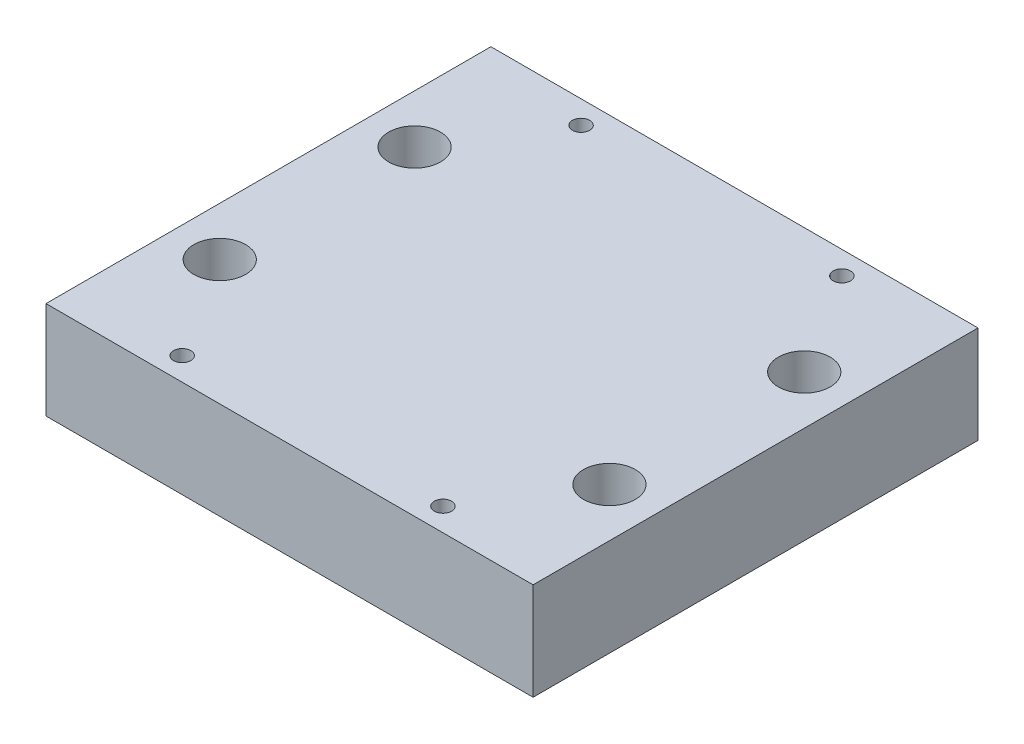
ISO-10303-21;
HEADER;
FILE_DESCRIPTION(('STEP AP214'),'2;1');
FILE_NAME('part.step','',(''),(''),'','','');
FILE_SCHEMA(('AUTOMOTIVE_DESIGN { 1 0 10303 214 1 1 1 1 }'));
ENDSEC;
DATA;
#1=APPLICATION_CONTEXT('core data for automotive mechanical design processes');
#2=APPLICATION_PROTOCOL_DEFINITION('international standard','automotive_design',2000,#1);
#3=PRODUCT_CONTEXT('',#1,'mechanical');
#4=PRODUCT('Part','Part','',(#3));
#5=PRODUCT_RELATED_PRODUCT_CATEGORY('part','',(#4));
#6=PRODUCT_DEFINITION_FORMATION('','',#4);
#7=PRODUCT_DEFINITION_CONTEXT('part definition',#1,'design');
#8=PRODUCT_DEFINITION('design','',#6,#7);
#9=PRODUCT_DEFINITION_SHAPE('','',#8);
#10=(LENGTH_UNIT() NAMED_UNIT(*) SI_UNIT(.MILLI.,.METRE.));
#11=(NAMED_UNIT(*) PLANE_ANGLE_UNIT() SI_UNIT($,.RADIAN.));
#12=(NAMED_UNIT(*) SI_UNIT($,.STERADIAN.) SOLID_ANGLE_UNIT());
#13=UNCERTAINTY_MEASURE_WITH_UNIT(LENGTH_MEASURE(1.E-05),#10,'distance_accuracy_value','');
#14=(GEOMETRIC_REPRESENTATION_CONTEXT(3) GLOBAL_UNCERTAINTY_ASSIGNED_CONTEXT((#13)) GLOBAL_UNIT_ASSIGNED_CONTEXT((#10,
#11,#12)) REPRESENTATION_CONTEXT('',''));
#15=CARTESIAN_POINT('',(0.,0.,0.));
#16=DIRECTION('',(0.,0.,1.));
#17=DIRECTION('',(1.,0.,0.));
#18=AXIS2_PLACEMENT_3D('',#15,#16,#17);
#19=CARTESIAN_POINT('',(-31.75,12.7,29.));
#20=DIRECTION('',(-1.,0.,0.));
#21=DIRECTION('',(0.,0.,1.));
#22=AXIS2_PLACEMENT_3D('',#19,#20,#21);
#23=PLANE('',#22);
#24=DIRECTION('',(0.,0.,-1.));
#25=VECTOR('',#24,1.);
#26=CARTESIAN_POINT('',(-31.75,0.,29.));
#27=LINE('',#26,#25);
#28=CARTESIAN_POINT('',(-31.75,0.,29.));
#29=VERTEX_POINT('',#28);
#30=CARTESIAN_POINT('',(-31.75,0.,-29.));
#31=VERTEX_POINT('',#30);
#32=EDGE_CURVE('E144',#29,#31,#27,.T.);
#33=ORIENTED_EDGE('',*,*,#32,.F.);
#34=DIRECTION('',(0.,-1.,0.));
#35=VECTOR('',#34,1.);
#36=CARTESIAN_POINT('',(-31.75,12.7,29.));
#37=LINE('',#36,#35);
#38=CARTESIAN_POINT('',(-31.75,12.7,29.));
#39=VERTEX_POINT('',#38);
#40=EDGE_CURVE('E11',#39,#29,#37,.T.);
#41=ORIENTED_EDGE('',*,*,#40,.F.);
#42=DIRECTION('',(0.,0.,-1.));
#43=VECTOR('',#42,1.);
#44=CARTESIAN_POINT('',(-31.75,12.7,29.));
#45=LINE('',#44,#43);
#46=CARTESIAN_POINT('',(-31.75,12.7,-29.));
#47=VERTEX_POINT('',#46);
#48=EDGE_CURVE('E145',#39,#47,#45,.T.);
#49=ORIENTED_EDGE('',*,*,#48,.T.);
#50=DIRECTION('',(0.,-1.,0.));
#51=VECTOR('',#50,1.);
#52=CARTESIAN_POINT('',(-31.75,12.7,-29.));
#53=LINE('',#52,#51);
#54=EDGE_CURVE('E46',#47,#31,#53,.T.);
#55=ORIENTED_EDGE('',*,*,#54,.T.);
#56=EDGE_LOOP('',(#33,#41,#49,#55));
#57=FACE_BOUND('',#56,.T.);
#58=ADVANCED_FACE('F43',(#57),#23,.T.);
#59=CARTESIAN_POINT('',(-31.75,12.7,29.));
#60=DIRECTION('',(0.,0.,-1.));
#61=DIRECTION('',(-1.,0.,0.));
#62=AXIS2_PLACEMENT_3D('',#59,#60,#61);
#63=PLANE('',#62);
#64=DIRECTION('',(1.,0.,0.));
#65=VECTOR('',#64,1.);
#66=CARTESIAN_POINT('',(-31.75,0.,29.));
#67=LINE('',#66,#65);
#68=CARTESIAN_POINT('',(31.75,0.,29.));
#69=VERTEX_POINT('',#68);
#70=EDGE_CURVE('E78',#29,#69,#67,.T.);
#71=ORIENTED_EDGE('',*,*,#70,.T.);
#72=DIRECTION('',(0.,-1.,0.));
#73=VECTOR('',#72,1.);
#74=CARTESIAN_POINT('',(31.75,12.7,29.));
#75=LINE('',#74,#73);
#76=CARTESIAN_POINT('',(31.75,12.7,29.));
#77=VERTEX_POINT('',#76);
#78=EDGE_CURVE('E53',#77,#69,#75,.T.);
#79=ORIENTED_EDGE('',*,*,#78,.F.);
#80=DIRECTION('',(1.,0.,0.));
#81=VECTOR('',#80,1.);
#82=CARTESIAN_POINT('',(-31.75,12.7,29.));
#83=LINE('',#82,#81);
#84=EDGE_CURVE('E154',#39,#77,#83,.T.);
#85=ORIENTED_EDGE('',*,*,#84,.F.);
#86=ORIENTED_EDGE('',*,*,#40,.T.);
#87=EDGE_LOOP('',(#71,#79,#85,#86));
#88=FACE_BOUND('',#87,.T.);
#89=ADVANCED_FACE('F185',(#88),#63,.F.);
#90=CARTESIAN_POINT('',(31.75,12.7,29.));
#91=DIRECTION('',(-1.,0.,0.));
#92=DIRECTION('',(0.,0.,1.));
#93=AXIS2_PLACEMENT_3D('',#90,#91,#92);
#94=PLANE('',#93);
#95=DIRECTION('',(0.,0.,-1.));
#96=VECTOR('',#95,1.);
#97=CARTESIAN_POINT('',(31.75,0.,29.));
#98=LINE('',#97,#96);
#99=CARTESIAN_POINT('',(31.75,0.,-29.));
#100=VERTEX_POINT('',#99);
#101=EDGE_CURVE('E164',#69,#100,#98,.T.);
#102=ORIENTED_EDGE('',*,*,#101,.T.);
#103=DIRECTION('',(0.,-1.,0.));
#104=VECTOR('',#103,1.);
#105=CARTESIAN_POINT('',(31.75,12.7,-29.));
#106=LINE('',#105,#104);
#107=CARTESIAN_POINT('',(31.75,12.7,-29.));
#108=VERTEX_POINT('',#107);
#109=EDGE_CURVE('E171',#108,#100,#106,.T.);
#110=ORIENTED_EDGE('',*,*,#109,.F.);
#111=DIRECTION('',(0.,0.,-1.));
#112=VECTOR('',#111,1.);
#113=CARTESIAN_POINT('',(31.75,12.7,29.));
#114=LINE('',#113,#112);
#115=EDGE_CURVE('E151',#77,#108,#114,.T.);
#116=ORIENTED_EDGE('',*,*,#115,.F.);
#117=ORIENTED_EDGE('',*,*,#78,.T.);
#118=EDGE_LOOP('',(#102,#110,#116,#117));
#119=FACE_BOUND('',#118,.T.);
#120=ADVANCED_FACE('F183',(#119),#94,.F.);
#121=CARTESIAN_POINT('',(-31.75,12.7,-29.));
#122=DIRECTION('',(0.,0.,-1.));
#123=DIRECTION('',(-1.,0.,0.));
#124=AXIS2_PLACEMENT_3D('',#121,#122,#123);
#125=PLANE('',#124);
#126=DIRECTION('',(1.,0.,0.));
#127=VECTOR('',#126,1.);
#128=CARTESIAN_POINT('',(-31.75,0.,-29.));
#129=LINE('',#128,#127);
#130=EDGE_CURVE('E160',#31,#100,#129,.T.);
#131=ORIENTED_EDGE('',*,*,#130,.F.);
#132=ORIENTED_EDGE('',*,*,#54,.F.);
#133=DIRECTION('',(1.,0.,0.));
#134=VECTOR('',#133,1.);
#135=CARTESIAN_POINT('',(-31.75,12.7,-29.));
#136=LINE('',#135,#134);
#137=EDGE_CURVE('E148',#47,#108,#136,.T.);
#138=ORIENTED_EDGE('',*,*,#137,.T.);
#139=ORIENTED_EDGE('',*,*,#109,.T.);
#140=EDGE_LOOP('',(#131,#132,#138,#139));
#141=FACE_BOUND('',#140,.T.);
#142=ADVANCED_FACE('F178',(#141),#125,.T.);
#143=CARTESIAN_POINT('',(0.,12.7,0.));
#144=DIRECTION('',(0.,-1.,0.));
#145=DIRECTION('',(0.,0.,-1.));
#146=AXIS2_PLACEMENT_3D('',#143,#144,#145);
#147=PLANE('',#146);
#148=CARTESIAN_POINT('',(-25.4,12.7,-12.7));
#149=DIRECTION('',(0.,1.,0.));
#150=DIRECTION('',(0.,0.,1.));
#151=AXIS2_PLACEMENT_3D('',#148,#149,#150);
#152=CIRCLE('',#151,3.37819999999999);
#153=CARTESIAN_POINT('',(-25.4,12.7,-9.32180000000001));
#154=VERTEX_POINT('',#153);
#155=EDGE_CURVE('E432',#154,#154,#152,.T.);
#156=ORIENTED_EDGE('',*,*,#155,.F.);
#157=EDGE_LOOP('',(#156));
#158=FACE_BOUND('',#157,.T.);
#159=CARTESIAN_POINT('',(25.4,12.7,-12.7));
#160=DIRECTION('',(0.,1.,0.));
#161=DIRECTION('',(0.,0.,1.));
#162=AXIS2_PLACEMENT_3D('',#159,#160,#161);
#163=CIRCLE('',#162,3.37819999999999);
#164=CARTESIAN_POINT('',(25.4,12.7,-9.32180000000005));
#165=VERTEX_POINT('',#164);
#166=EDGE_CURVE('E437',#165,#165,#163,.T.);
#167=ORIENTED_EDGE('',*,*,#166,.F.);
#168=EDGE_LOOP('',(#167));
#169=FACE_BOUND('',#168,.T.);
#170=CARTESIAN_POINT('',(-25.4,12.7,12.7));
#171=DIRECTION('',(0.,1.,0.));
#172=DIRECTION('',(0.,0.,1.));
#173=AXIS2_PLACEMENT_3D('',#170,#171,#172);
#174=CIRCLE('',#173,3.37819999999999);
#175=CARTESIAN_POINT('',(-25.4,12.7,16.0782));
#176=VERTEX_POINT('',#175);
#177=EDGE_CURVE('E447',#176,#176,#174,.T.);
#178=ORIENTED_EDGE('',*,*,#177,.F.);
#179=EDGE_LOOP('',(#178));
#180=FACE_BOUND('',#179,.T.);
#181=CARTESIAN_POINT('',(25.4,12.7,12.7));
#182=DIRECTION('',(0.,1.,0.));
#183=DIRECTION('',(0.,0.,1.));
#184=AXIS2_PLACEMENT_3D('',#181,#182,#183);
#185=CIRCLE('',#184,3.37819999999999);
#186=CARTESIAN_POINT('',(25.4,12.7,16.0782));
#187=VERTEX_POINT('',#186);
#188=EDGE_CURVE('E455',#187,#187,#185,.T.);
#189=ORIENTED_EDGE('',*,*,#188,.F.);
#190=EDGE_LOOP('',(#189));
#191=FACE_BOUND('',#190,.T.);
#192=CARTESIAN_POINT('',(-17.,12.7,-26.));
#193=DIRECTION('',(0.,1.,0.));
#194=DIRECTION('',(0.,0.,1.));
#195=AXIS2_PLACEMENT_3D('',#192,#193,#194);
#196=CIRCLE('',#195,1.13029999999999);
#197=CARTESIAN_POINT('',(-17.,12.7,-24.8697));
#198=VERTEX_POINT('',#197);
#199=EDGE_CURVE('E112',#198,#198,#196,.T.);
#200=ORIENTED_EDGE('',*,*,#199,.F.);
#201=EDGE_LOOP('',(#200));
#202=FACE_BOUND('',#201,.T.);
#203=CARTESIAN_POINT('',(17.,12.7,-26.));
#204=DIRECTION('',(0.,1.,0.));
#205=DIRECTION('',(0.,0.,1.));
#206=AXIS2_PLACEMENT_3D('',#203,#204,#205);
#207=CIRCLE('',#206,1.13029999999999);
#208=CARTESIAN_POINT('',(17.,12.7,-24.8697));
#209=VERTEX_POINT('',#208);
#210=EDGE_CURVE('E111',#209,#209,#207,.T.);
#211=ORIENTED_EDGE('',*,*,#210,.F.);
#212=EDGE_LOOP('',(#211));
#213=FACE_BOUND('',#212,.T.);
#214=CARTESIAN_POINT('',(17.,12.7,26.));
#215=DIRECTION('',(0.,1.,0.));
#216=DIRECTION('',(0.,0.,1.));
#217=AXIS2_PLACEMENT_3D('',#214,#215,#216);
#218=CIRCLE('',#217,1.13029999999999);
#219=CARTESIAN_POINT('',(17.,12.7,27.1303));
#220=VERTEX_POINT('',#219);
#221=EDGE_CURVE('E128',#220,#220,#218,.T.);
#222=ORIENTED_EDGE('',*,*,#221,.F.);
#223=EDGE_LOOP('',(#222));
#224=FACE_BOUND('',#223,.T.);
#225=CARTESIAN_POINT('',(-17.,12.7,26.));
#226=DIRECTION('',(0.,1.,0.));
#227=DIRECTION('',(0.,0.,1.));
#228=AXIS2_PLACEMENT_3D('',#225,#226,#227);
#229=CIRCLE('',#228,1.13029999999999);
#230=CARTESIAN_POINT('',(-17.,12.7,27.1303));
#231=VERTEX_POINT('',#230);
#232=EDGE_CURVE('E136',#231,#231,#229,.T.);
#233=ORIENTED_EDGE('',*,*,#232,.F.);
#234=EDGE_LOOP('',(#233));
#235=FACE_BOUND('',#234,.T.);
#236=ORIENTED_EDGE('',*,*,#48,.F.);
#237=ORIENTED_EDGE('',*,*,#84,.T.);
#238=ORIENTED_EDGE('',*,*,#115,.T.);
#239=ORIENTED_EDGE('',*,*,#137,.F.);
#240=EDGE_LOOP('',(#236,#237,#238,#239));
#241=FACE_BOUND('',#240,.T.);
#242=ADVANCED_FACE('F187',(#158,#169,#180,#191,#202,#213,#224,#235,#241),#147,.F.);
#243=CARTESIAN_POINT('',(0.,0.,0.));
#244=DIRECTION('',(0.,-1.,0.));
#245=DIRECTION('',(0.,0.,-1.));
#246=AXIS2_PLACEMENT_3D('',#243,#244,#245);
#247=PLANE('',#246);
#248=CARTESIAN_POINT('',(-25.4,0.,-12.7));
#249=DIRECTION('',(0.,1.,0.));
#250=DIRECTION('',(0.,0.,1.));
#251=AXIS2_PLACEMENT_3D('',#248,#249,#250);
#252=CIRCLE('',#251,3.37819999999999);
#253=CARTESIAN_POINT('',(-25.4,0.,-9.32180000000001));
#254=VERTEX_POINT('',#253);
#255=EDGE_CURVE('E430',#254,#254,#252,.T.);
#256=ORIENTED_EDGE('',*,*,#255,.T.);
#257=EDGE_LOOP('',(#256));
#258=FACE_BOUND('',#257,.T.);
#259=CARTESIAN_POINT('',(25.4,0.,-12.7));
#260=DIRECTION('',(0.,1.,0.));
#261=DIRECTION('',(0.,0.,1.));
#262=AXIS2_PLACEMENT_3D('',#259,#260,#261);
#263=CIRCLE('',#262,3.37819999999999);
#264=CARTESIAN_POINT('',(25.4,0.,-9.32180000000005));
#265=VERTEX_POINT('',#264);
#266=EDGE_CURVE('E443',#265,#265,#263,.T.);
#267=ORIENTED_EDGE('',*,*,#266,.T.);
#268=EDGE_LOOP('',(#267));
#269=FACE_BOUND('',#268,.T.);
#270=CARTESIAN_POINT('',(-25.4,0.,12.7));
#271=DIRECTION('',(0.,1.,0.));
#272=DIRECTION('',(0.,0.,1.));
#273=AXIS2_PLACEMENT_3D('',#270,#271,#272);
#274=CIRCLE('',#273,3.37819999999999);
#275=CARTESIAN_POINT('',(-25.4,0.,16.0782));
#276=VERTEX_POINT('',#275);
#277=EDGE_CURVE('E451',#276,#276,#274,.T.);
#278=ORIENTED_EDGE('',*,*,#277,.T.);
#279=EDGE_LOOP('',(#278));
#280=FACE_BOUND('',#279,.T.);
#281=CARTESIAN_POINT('',(25.4,0.,12.7));
#282=DIRECTION('',(0.,1.,0.));
#283=DIRECTION('',(0.,0.,1.));
#284=AXIS2_PLACEMENT_3D('',#281,#282,#283);
#285=CIRCLE('',#284,3.37819999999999);
#286=CARTESIAN_POINT('',(25.4,0.,16.0782));
#287=VERTEX_POINT('',#286);
#288=EDGE_CURVE('E121',#287,#287,#285,.T.);
#289=ORIENTED_EDGE('',*,*,#288,.T.);
#290=EDGE_LOOP('',(#289));
#291=FACE_BOUND('',#290,.T.);
#292=ORIENTED_EDGE('',*,*,#32,.T.);
#293=ORIENTED_EDGE('',*,*,#130,.T.);
#294=ORIENTED_EDGE('',*,*,#101,.F.);
#295=ORIENTED_EDGE('',*,*,#70,.F.);
#296=EDGE_LOOP('',(#292,#293,#294,#295));
#297=FACE_BOUND('',#296,.T.);
#298=ADVANCED_FACE('F181',(#258,#269,#280,#291,#297),#247,.T.);
#299=CARTESIAN_POINT('',(-17.,6.35,26.));
#300=DIRECTION('',(0.,1.,0.));
#301=DIRECTION('',(0.,0.,1.));
#302=AXIS2_PLACEMENT_3D('',#299,#300,#301);
#303=CONICAL_SURFACE('',#302,1.1303,1.02974425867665);
#304=CARTESIAN_POINT('',(-17.,5.67084724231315,26.));
#305=VERTEX_POINT('',#304);
#306=VERTEX_LOOP('',#305);
#307=FACE_BOUND('',#306,.T.);
#308=CARTESIAN_POINT('',(-17.,6.35,26.));
#309=DIRECTION('',(0.,1.,0.));
#310=DIRECTION('',(0.,0.,1.));
#311=AXIS2_PLACEMENT_3D('',#308,#309,#310);
#312=CIRCLE('',#311,1.1303);
#313=CARTESIAN_POINT('',(-17.,6.35,27.1303));
#314=VERTEX_POINT('',#313);
#315=EDGE_CURVE('E140',#314,#314,#312,.T.);
#316=ORIENTED_EDGE('',*,*,#315,.T.);
#317=EDGE_LOOP('',(#316));
#318=FACE_BOUND('',#317,.T.);
#319=ADVANCED_FACE('F195',(#307,#318),#303,.F.);
#320=CARTESIAN_POINT('',(-17.,12.7,26.));
#321=DIRECTION('',(0.,1.,0.));
#322=DIRECTION('',(0.,0.,1.));
#323=AXIS2_PLACEMENT_3D('',#320,#321,#322);
#324=CYLINDRICAL_SURFACE('',#323,1.13029999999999);
#325=ORIENTED_EDGE('',*,*,#315,.F.);
#326=EDGE_LOOP('',(#325));
#327=FACE_BOUND('',#326,.T.);
#328=ORIENTED_EDGE('',*,*,#232,.T.);
#329=EDGE_LOOP('',(#328));
#330=FACE_BOUND('',#329,.T.);
#331=ADVANCED_FACE('F227',(#327,#330),#324,.F.);
#332=CARTESIAN_POINT('',(17.,6.35,26.));
#333=DIRECTION('',(0.,1.,0.));
#334=DIRECTION('',(0.,0.,1.));
#335=AXIS2_PLACEMENT_3D('',#332,#333,#334);
#336=CONICAL_SURFACE('',#335,1.1303,1.02974425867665);
#337=CARTESIAN_POINT('',(17.,5.67084724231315,26.));
#338=VERTEX_POINT('',#337);
#339=VERTEX_LOOP('',#338);
#340=FACE_BOUND('',#339,.T.);
#341=CARTESIAN_POINT('',(17.,6.35,26.));
#342=DIRECTION('',(0.,1.,0.));
#343=DIRECTION('',(0.,0.,1.));
#344=AXIS2_PLACEMENT_3D('',#341,#342,#343);
#345=CIRCLE('',#344,1.1303);
#346=CARTESIAN_POINT('',(17.,6.35,27.1303));
#347=VERTEX_POINT('',#346);
#348=EDGE_CURVE('E132',#347,#347,#345,.T.);
#349=ORIENTED_EDGE('',*,*,#348,.T.);
#350=EDGE_LOOP('',(#349));
#351=FACE_BOUND('',#350,.T.);
#352=ADVANCED_FACE('F239',(#340,#351),#336,.F.);
#353=CARTESIAN_POINT('',(17.,12.7,26.));
#354=DIRECTION('',(0.,1.,0.));
#355=DIRECTION('',(0.,0.,1.));
#356=AXIS2_PLACEMENT_3D('',#353,#354,#355);
#357=CYLINDRICAL_SURFACE('',#356,1.13029999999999);
#358=ORIENTED_EDGE('',*,*,#348,.F.);
#359=EDGE_LOOP('',(#358));
#360=FACE_BOUND('',#359,.T.);
#361=ORIENTED_EDGE('',*,*,#221,.T.);
#362=EDGE_LOOP('',(#361));
#363=FACE_BOUND('',#362,.T.);
#364=ADVANCED_FACE('F252',(#360,#363),#357,.F.);
#365=CARTESIAN_POINT('',(17.,6.35,-26.));
#366=DIRECTION('',(0.,1.,0.));
#367=DIRECTION('',(0.,0.,1.));
#368=AXIS2_PLACEMENT_3D('',#365,#366,#367);
#369=CONICAL_SURFACE('',#368,1.1303,1.02974425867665);
#370=CARTESIAN_POINT('',(17.,5.67084724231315,-26.));
#371=VERTEX_POINT('',#370);
#372=VERTEX_LOOP('',#371);
#373=FACE_BOUND('',#372,.T.);
#374=CARTESIAN_POINT('',(17.,6.35,-26.));
#375=DIRECTION('',(0.,1.,0.));
#376=DIRECTION('',(0.,0.,1.));
#377=AXIS2_PLACEMENT_3D('',#374,#375,#376);
#378=CIRCLE('',#377,1.1303);
#379=CARTESIAN_POINT('',(17.,6.35,-24.8697));
#380=VERTEX_POINT('',#379);
#381=EDGE_CURVE('E118',#380,#380,#378,.T.);
#382=ORIENTED_EDGE('',*,*,#381,.T.);
#383=EDGE_LOOP('',(#382));
#384=FACE_BOUND('',#383,.T.);
#385=ADVANCED_FACE('F263',(#373,#384),#369,.F.);
#386=CARTESIAN_POINT('',(17.,12.7,-26.));
#387=DIRECTION('',(0.,1.,0.));
#388=DIRECTION('',(0.,0.,1.));
#389=AXIS2_PLACEMENT_3D('',#386,#387,#388);
#390=CYLINDRICAL_SURFACE('',#389,1.13029999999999);
#391=ORIENTED_EDGE('',*,*,#381,.F.);
#392=EDGE_LOOP('',(#391));
#393=FACE_BOUND('',#392,.T.);
#394=ORIENTED_EDGE('',*,*,#210,.T.);
#395=EDGE_LOOP('',(#394));
#396=FACE_BOUND('',#395,.T.);
#397=ADVANCED_FACE('F104',(#393,#396),#390,.F.);
#398=CARTESIAN_POINT('',(-17.,6.35,-26.));
#399=DIRECTION('',(0.,1.,0.));
#400=DIRECTION('',(0.,0.,1.));
#401=AXIS2_PLACEMENT_3D('',#398,#399,#400);
#402=CONICAL_SURFACE('',#401,1.1303,1.02974425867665);
#403=CARTESIAN_POINT('',(-17.,5.67084724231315,-26.));
#404=VERTEX_POINT('',#403);
#405=VERTEX_LOOP('',#404);
#406=FACE_BOUND('',#405,.T.);
#407=CARTESIAN_POINT('',(-17.,6.35,-26.));
#408=DIRECTION('',(0.,1.,0.));
#409=DIRECTION('',(0.,0.,1.));
#410=AXIS2_PLACEMENT_3D('',#407,#408,#409);
#411=CIRCLE('',#410,1.1303);
#412=CARTESIAN_POINT('',(-17.,6.35,-24.8697));
#413=VERTEX_POINT('',#412);
#414=EDGE_CURVE('E108',#413,#413,#411,.T.);
#415=ORIENTED_EDGE('',*,*,#414,.T.);
#416=EDGE_LOOP('',(#415));
#417=FACE_BOUND('',#416,.T.);
#418=ADVANCED_FACE('F100',(#406,#417),#402,.F.);
#419=CARTESIAN_POINT('',(-17.,12.7,-26.));
#420=DIRECTION('',(0.,1.,0.));
#421=DIRECTION('',(0.,0.,1.));
#422=AXIS2_PLACEMENT_3D('',#419,#420,#421);
#423=CYLINDRICAL_SURFACE('',#422,1.13029999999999);
#424=ORIENTED_EDGE('',*,*,#414,.F.);
#425=EDGE_LOOP('',(#424));
#426=FACE_BOUND('',#425,.T.);
#427=ORIENTED_EDGE('',*,*,#199,.T.);
#428=EDGE_LOOP('',(#427));
#429=FACE_BOUND('',#428,.T.);
#430=ADVANCED_FACE('F103',(#426,#429),#423,.F.);
#431=CARTESIAN_POINT('',(25.4,12.7,12.7));
#432=DIRECTION('',(0.,1.,0.));
#433=DIRECTION('',(0.,0.,1.));
#434=AXIS2_PLACEMENT_3D('',#431,#432,#433);
#435=CYLINDRICAL_SURFACE('',#434,3.37819999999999);
#436=ORIENTED_EDGE('',*,*,#288,.F.);
#437=EDGE_LOOP('',(#436));
#438=FACE_BOUND('',#437,.T.);
#439=ORIENTED_EDGE('',*,*,#188,.T.);
#440=EDGE_LOOP('',(#439));
#441=FACE_BOUND('',#440,.T.);
#442=ADVANCED_FACE('F304',(#438,#441),#435,.F.);
#443=CARTESIAN_POINT('',(-25.4,12.7,12.7));
#444=DIRECTION('',(0.,1.,0.));
#445=DIRECTION('',(0.,0.,1.));
#446=AXIS2_PLACEMENT_3D('',#443,#444,#445);
#447=CYLINDRICAL_SURFACE('',#446,3.37819999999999);
#448=ORIENTED_EDGE('',*,*,#277,.F.);
#449=EDGE_LOOP('',(#448));
#450=FACE_BOUND('',#449,.T.);
#451=ORIENTED_EDGE('',*,*,#177,.T.);
#452=EDGE_LOOP('',(#451));
#453=FACE_BOUND('',#452,.T.);
#454=ADVANCED_FACE('F327',(#450,#453),#447,.F.);
#455=CARTESIAN_POINT('',(25.4,12.7,-12.7));
#456=DIRECTION('',(0.,1.,0.));
#457=DIRECTION('',(0.,0.,1.));
#458=AXIS2_PLACEMENT_3D('',#455,#456,#457);
#459=CYLINDRICAL_SURFACE('',#458,3.37819999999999);
#460=ORIENTED_EDGE('',*,*,#266,.F.);
#461=EDGE_LOOP('',(#460));
#462=FACE_BOUND('',#461,.T.);
#463=ORIENTED_EDGE('',*,*,#166,.T.);
#464=EDGE_LOOP('',(#463));
#465=FACE_BOUND('',#464,.T.);
#466=ADVANCED_FACE('F338',(#462,#465),#459,.F.);
#467=CARTESIAN_POINT('',(-25.4,12.7,-12.7));
#468=DIRECTION('',(0.,1.,0.));
#469=DIRECTION('',(0.,0.,1.));
#470=AXIS2_PLACEMENT_3D('',#467,#468,#469);
#471=CYLINDRICAL_SURFACE('',#470,3.37819999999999);
#472=ORIENTED_EDGE('',*,*,#255,.F.);
#473=EDGE_LOOP('',(#472));
#474=FACE_BOUND('',#473,.T.);
#475=ORIENTED_EDGE('',*,*,#155,.T.);
#476=EDGE_LOOP('',(#475));
#477=FACE_BOUND('',#476,.T.);
#478=ADVANCED_FACE('F349',(#474,#477),#471,.F.);
#479=CLOSED_SHELL('',(#58,#89,#120,#142,#242,#298,#319,#331,#352,#364,#385,#397,#418,#430,#442,
#454,#466,#478));
#480=MANIFOLD_SOLID_BREP('B2',#479);
#481=ADVANCED_BREP_SHAPE_REPRESENTATION('',(#18,#480),#14);
#482=SHAPE_DEFINITION_REPRESENTATION(#9,#481);
ENDSEC;
END-ISO-10303-21;
